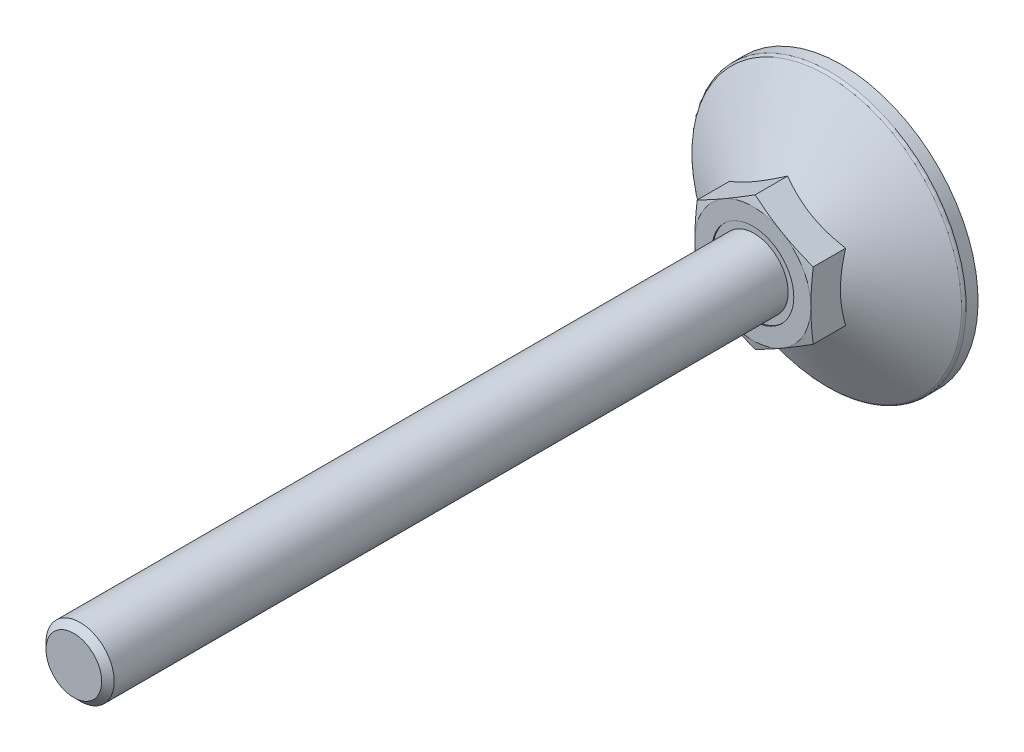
ISO-10303-21;
HEADER;
FILE_DESCRIPTION(('STEP AP214'),'2;1');
FILE_NAME('part.step','',(''),(''),'','','');
FILE_SCHEMA(('AUTOMOTIVE_DESIGN { 1 0 10303 214 1 1 1 1 }'));
ENDSEC;
DATA;
#1=APPLICATION_CONTEXT('core data for automotive mechanical design processes');
#2=APPLICATION_PROTOCOL_DEFINITION('international standard','automotive_design',2000,#1);
#3=PRODUCT_CONTEXT('',#1,'mechanical');
#4=PRODUCT('Part','Part','',(#3));
#5=PRODUCT_RELATED_PRODUCT_CATEGORY('part','',(#4));
#6=PRODUCT_DEFINITION_FORMATION('','',#4);
#7=PRODUCT_DEFINITION_CONTEXT('part definition',#1,'design');
#8=PRODUCT_DEFINITION('design','',#6,#7);
#9=PRODUCT_DEFINITION_SHAPE('','',#8);
#10=(LENGTH_UNIT() NAMED_UNIT(*) SI_UNIT(.MILLI.,.METRE.));
#11=(NAMED_UNIT(*) PLANE_ANGLE_UNIT() SI_UNIT($,.RADIAN.));
#12=(NAMED_UNIT(*) SI_UNIT($,.STERADIAN.) SOLID_ANGLE_UNIT());
#13=UNCERTAINTY_MEASURE_WITH_UNIT(LENGTH_MEASURE(1.E-05),#10,'distance_accuracy_value','');
#14=(GEOMETRIC_REPRESENTATION_CONTEXT(3) GLOBAL_UNCERTAINTY_ASSIGNED_CONTEXT((#13)) GLOBAL_UNIT_ASSIGNED_CONTEXT((#10,
#11,#12)) REPRESENTATION_CONTEXT('',''));
#15=CARTESIAN_POINT('',(0.,0.,0.));
#16=DIRECTION('',(0.,0.,1.));
#17=DIRECTION('',(1.,0.,0.));
#18=AXIS2_PLACEMENT_3D('',#15,#16,#17);
#19=CARTESIAN_POINT('',(0.,9.8149545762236,27.));
#20=DIRECTION('',(0.5,-0.86602540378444,0.));
#21=DIRECTION('',(0.86602540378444,0.5,0.));
#22=AXIS2_PLACEMENT_3D('',#19,#20,#21);
#23=PLANE('',#22);
#24=CARTESIAN_POINT('',(0.000200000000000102,9.81507004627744,12.6476280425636));
#25=CARTESIAN_POINT('',(-0.352800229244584,9.61126526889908,12.7022599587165));
#26=CARTESIAN_POINT('',(-0.706440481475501,9.40709097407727,12.7518566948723));
#27=CARTESIAN_POINT('',(-1.41496987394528,8.99802133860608,12.8389934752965));
#28=CARTESIAN_POINT('',(-1.76985946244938,8.79312573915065,12.8765286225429));
#29=CARTESIAN_POINT('',(-2.47873586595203,8.38385575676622,12.9373509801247));
#30=CARTESIAN_POINT('',(-2.83271788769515,8.17948414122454,12.9607107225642));
#31=CARTESIAN_POINT('',(-3.5411333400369,7.77048028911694,12.9920337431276));
#32=CARTESIAN_POINT('',(-3.89556667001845,7.56584811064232,13.));
#33=CARTESIAN_POINT('',(-4.60443332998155,7.15658375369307,13.));
#34=CARTESIAN_POINT('',(-4.9588666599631,6.95195157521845,12.9920337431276));
#35=CARTESIAN_POINT('',(-5.66728211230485,6.54294772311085,12.9607107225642));
#36=CARTESIAN_POINT('',(-6.02126413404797,6.33857610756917,12.9373509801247));
#37=CARTESIAN_POINT('',(-6.73014053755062,5.92930612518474,12.8765286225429));
#38=CARTESIAN_POINT('',(-7.08503012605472,5.7244105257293,12.8389934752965));
#39=CARTESIAN_POINT('',(-7.7935595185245,5.31534089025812,12.7518566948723));
#40=CARTESIAN_POINT('',(-8.14719977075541,5.11116659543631,12.7022599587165));
#41=CARTESIAN_POINT('',(-8.5002,4.90736181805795,12.6476280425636));
#42=B_SPLINE_CURVE_WITH_KNOTS('',3,(#24,#25,#26,#27,#28,#29,#30,#31,#32,#33,#34,#35,#36,#37,#38,
#39,#40,#41),.UNSPECIFIED.,.F.,.F.,(4,2,2,2,2,2,2,2,4),(0.,1.23382789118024,2.46815608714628,
3.69611406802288,4.92383440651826,6.15155474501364,7.37951272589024,8.61384092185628,
9.84766881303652),.UNSPECIFIED.);
#43=CARTESIAN_POINT('',(0.,9.8149545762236,12.6476589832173));
#44=VERTEX_POINT('',#43);
#45=CARTESIAN_POINT('',(-4.25,7.36121593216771,13.));
#46=VERTEX_POINT('',#45);
#47=EDGE_CURVE('E269',#44,#46,#42,.T.);
#48=ORIENTED_EDGE('',*,*,#47,.F.);
#49=DIRECTION('',(0.,0.,-1.));
#50=VECTOR('',#49,1.);
#51=CARTESIAN_POINT('',(0.,9.8149545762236,27.));
#52=LINE('',#51,#50);
#53=CARTESIAN_POINT('',(0.,9.8149545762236,7.90533871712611));
#54=VERTEX_POINT('',#53);
#55=EDGE_CURVE('E43',#44,#54,#52,.T.);
#56=ORIENTED_EDGE('',*,*,#55,.T.);
#57=CARTESIAN_POINT('',(-8.5002,4.90736181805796,7.90527204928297));
#58=CARTESIAN_POINT('',(-8.31336077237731,5.0152334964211,7.96754195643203));
#59=CARTESIAN_POINT('',(-8.1258249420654,5.12350735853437,8.02698579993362));
#60=CARTESIAN_POINT('',(-7.74923024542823,5.34093440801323,8.13944298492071));
#61=CARTESIAN_POINT('',(-7.56017075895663,5.45008795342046,8.19245355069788));
#62=CARTESIAN_POINT('',(-6.98996524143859,5.77929626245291,8.34079470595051));
#63=CARTESIAN_POINT('',(-6.60656835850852,6.00065055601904,8.42516916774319));
#64=CARTESIAN_POINT('',(-6.03282233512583,6.33190297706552,8.52410807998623));
#65=CARTESIAN_POINT('',(-5.8441872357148,6.44081150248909,8.55229289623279));
#66=CARTESIAN_POINT('',(-5.46606397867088,6.65912106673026,8.59955401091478));
#67=CARTESIAN_POINT('',(-5.27657589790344,6.76852206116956,8.61863111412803));
#68=CARTESIAN_POINT('',(-4.89727347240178,6.98751241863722,8.64719332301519));
#69=CARTESIAN_POINT('',(-4.70745974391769,7.0971014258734,8.65668931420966));
#70=CARTESIAN_POINT('',(-4.3276569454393,7.31638067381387,8.66588571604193));
#71=CARTESIAN_POINT('',(-4.13766788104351,7.42607091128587,8.66558642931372));
#72=CARTESIAN_POINT('',(-3.78247698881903,7.63114046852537,8.65587362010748));
#73=CARTESIAN_POINT('',(-3.61725009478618,7.7265342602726,8.64764492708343));
#74=CARTESIAN_POINT('',(-3.28718328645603,7.91709842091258,8.62393885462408));
#75=CARTESIAN_POINT('',(-3.12234339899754,8.01226877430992,8.60846098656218));
#76=CARTESIAN_POINT('',(-2.62846189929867,8.29741139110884,8.55151947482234));
#77=CARTESIAN_POINT('',(-2.30029449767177,8.48687892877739,8.49955503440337));
#78=CARTESIAN_POINT('',(-1.64047857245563,8.86782383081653,8.36964315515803));
#79=CARTESIAN_POINT('',(-1.30891425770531,9.0592525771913,8.29114502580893));
#80=CARTESIAN_POINT('',(-0.650730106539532,9.43925537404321,8.11298675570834));
#81=CARTESIAN_POINT('',(-0.324101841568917,9.62783429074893,8.01336845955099));
#82=CARTESIAN_POINT('',(0.000199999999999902,9.81507004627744,7.90527204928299));
#83=B_SPLINE_CURVE_WITH_KNOTS('',3,(#57,#58,#59,#60,#61,#62,#63,#64,#65,#66,#67,#68,#69,#70,#71,
#72,#73,#74,#75,#76,#77,#78,#79,#80,#81,#82),.UNSPECIFIED.,.F.,.F.,(4,2,2,2,2,2,2,2,2,2,2,2,4),
(0.,0.673596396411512,1.34748239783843,2.69805431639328,3.35679995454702,4.01548737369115,
4.67342558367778,5.33134346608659,5.90409556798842,6.47688628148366,7.62328361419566,
8.79510569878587,9.96462743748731),.UNSPECIFIED.);
#84=CARTESIAN_POINT('',(-8.5,4.9074772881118,7.90533871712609));
#85=VERTEX_POINT('',#84);
#86=EDGE_CURVE('E237',#85,#54,#83,.T.);
#87=ORIENTED_EDGE('',*,*,#86,.F.);
#88=DIRECTION('',(0.,0.,-1.));
#89=VECTOR('',#88,1.);
#90=CARTESIAN_POINT('',(-8.5,4.9074772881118,27.));
#91=LINE('',#90,#89);
#92=CARTESIAN_POINT('',(-8.5,4.9074772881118,12.6476589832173));
#93=VERTEX_POINT('',#92);
#94=EDGE_CURVE('E282',#93,#85,#91,.T.);
#95=ORIENTED_EDGE('',*,*,#94,.F.);
#96=EDGE_CURVE('E169',#46,#93,#42,.T.);
#97=ORIENTED_EDGE('',*,*,#96,.F.);
#98=EDGE_LOOP('',(#48,#56,#87,#95,#97));
#99=FACE_BOUND('',#98,.T.);
#100=ADVANCED_FACE('F14',(#99),#23,.F.);
#101=CARTESIAN_POINT('',(8.5,4.9074772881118,27.));
#102=DIRECTION('',(-0.5,-0.86602540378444,0.));
#103=DIRECTION('',(0.86602540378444,-0.5,0.));
#104=AXIS2_PLACEMENT_3D('',#101,#102,#103);
#105=PLANE('',#104);
#106=CARTESIAN_POINT('',(8.5002,4.90736181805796,12.6476280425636));
#107=CARTESIAN_POINT('',(8.14719977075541,5.11116659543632,12.7022599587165));
#108=CARTESIAN_POINT('',(7.7935595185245,5.31534089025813,12.7518566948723));
#109=CARTESIAN_POINT('',(7.08503012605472,5.72441052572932,12.8389934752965));
#110=CARTESIAN_POINT('',(6.73014053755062,5.92930612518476,12.8765286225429));
#111=CARTESIAN_POINT('',(6.02126413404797,6.33857610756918,12.9373509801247));
#112=CARTESIAN_POINT('',(5.66728211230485,6.54294772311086,12.9607107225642));
#113=CARTESIAN_POINT('',(4.9588666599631,6.95195157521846,12.9920337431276));
#114=CARTESIAN_POINT('',(4.60443332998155,7.15658375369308,13.));
#115=CARTESIAN_POINT('',(3.89556667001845,7.56584811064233,13.));
#116=CARTESIAN_POINT('',(3.5411333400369,7.77048028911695,12.9920337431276));
#117=CARTESIAN_POINT('',(2.83271788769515,8.17948414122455,12.9607107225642));
#118=CARTESIAN_POINT('',(2.47873586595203,8.38385575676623,12.9373509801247));
#119=CARTESIAN_POINT('',(1.76985946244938,8.79312573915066,12.8765286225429));
#120=CARTESIAN_POINT('',(1.41496987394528,8.9980213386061,12.8389934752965));
#121=CARTESIAN_POINT('',(0.706440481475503,9.40709097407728,12.7518566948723));
#122=CARTESIAN_POINT('',(0.352800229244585,9.61126526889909,12.7022599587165));
#123=CARTESIAN_POINT('',(-0.000200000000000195,9.81507004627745,12.6476280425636));
#124=B_SPLINE_CURVE_WITH_KNOTS('',3,(#106,#107,#108,#109,#110,#111,#112,#113,#114,#115,#116,
#117,#118,#119,#120,#121,#122,#123),.UNSPECIFIED.,.F.,.F.,(4,2,2,2,2,2,2,2,4),(0.,
1.23382789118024,2.46815608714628,3.69611406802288,4.92383440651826,6.15155474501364,
7.37951272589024,8.61384092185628,9.84766881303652),.UNSPECIFIED.);
#125=CARTESIAN_POINT('',(8.5,4.9074772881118,12.6476589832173));
#126=VERTEX_POINT('',#125);
#127=CARTESIAN_POINT('',(4.25,7.36121593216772,13.));
#128=VERTEX_POINT('',#127);
#129=EDGE_CURVE('E121',#126,#128,#124,.T.);
#130=ORIENTED_EDGE('',*,*,#129,.F.);
#131=DIRECTION('',(0.,0.,-1.));
#132=VECTOR('',#131,1.);
#133=CARTESIAN_POINT('',(8.5,4.9074772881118,27.));
#134=LINE('',#133,#132);
#135=CARTESIAN_POINT('',(8.5,4.9074772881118,7.90533871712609));
#136=VERTEX_POINT('',#135);
#137=EDGE_CURVE('E128',#126,#136,#134,.T.);
#138=ORIENTED_EDGE('',*,*,#137,.T.);
#139=CARTESIAN_POINT('',(-0.0002,9.81507004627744,7.90527204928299));
#140=CARTESIAN_POINT('',(0.186639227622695,9.7071983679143,7.96754195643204));
#141=CARTESIAN_POINT('',(0.374175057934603,9.59892450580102,8.02698579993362));
#142=CARTESIAN_POINT('',(0.750769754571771,9.38149745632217,8.13944298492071));
#143=CARTESIAN_POINT('',(0.939829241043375,9.27234391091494,8.19245355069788));
#144=CARTESIAN_POINT('',(1.51003475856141,8.94313560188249,8.34079470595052));
#145=CARTESIAN_POINT('',(1.89343164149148,8.72178130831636,8.42516916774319));
#146=CARTESIAN_POINT('',(2.46717766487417,8.39052888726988,8.52410807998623));
#147=CARTESIAN_POINT('',(2.6558127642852,8.28162036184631,8.55229289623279));
#148=CARTESIAN_POINT('',(3.03393602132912,8.06331079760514,8.59955401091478));
#149=CARTESIAN_POINT('',(3.22342410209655,7.95390980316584,8.61863111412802));
#150=CARTESIAN_POINT('',(3.60272652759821,7.73491944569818,8.64719332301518));
#151=CARTESIAN_POINT('',(3.79254025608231,7.62533043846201,8.65668931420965));
#152=CARTESIAN_POINT('',(4.1723430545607,7.40605119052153,8.66588571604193));
#153=CARTESIAN_POINT('',(4.36233211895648,7.29636095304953,8.66558642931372));
#154=CARTESIAN_POINT('',(4.71752301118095,7.09129139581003,8.65587362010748));
#155=CARTESIAN_POINT('',(4.88274990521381,6.9958976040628,8.64764492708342));
#156=CARTESIAN_POINT('',(5.21281671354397,6.80533344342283,8.62393885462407));
#157=CARTESIAN_POINT('',(5.37765660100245,6.71016309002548,8.60846098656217));
#158=CARTESIAN_POINT('',(5.87153810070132,6.42502047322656,8.55151947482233));
#159=CARTESIAN_POINT('',(6.19970550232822,6.23555293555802,8.49955503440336));
#160=CARTESIAN_POINT('',(6.85952142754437,5.85460803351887,8.36964315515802));
#161=CARTESIAN_POINT('',(7.19108574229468,5.6631792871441,8.29114502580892));
#162=CARTESIAN_POINT('',(7.84926989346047,5.28317649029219,8.11298675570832));
#163=CARTESIAN_POINT('',(8.17589815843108,5.09459757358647,8.01336845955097));
#164=CARTESIAN_POINT('',(8.5002,4.90736181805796,7.90527204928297));
#165=B_SPLINE_CURVE_WITH_KNOTS('',3,(#139,#140,#141,#142,#143,#144,#145,#146,#147,#148,#149,
#150,#151,#152,#153,#154,#155,#156,#157,#158,#159,#160,#161,#162,#163,#164),.UNSPECIFIED.,.F.,
.F.,(4,2,2,2,2,2,2,2,2,2,2,2,4),(0.,0.673596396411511,1.34748239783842,2.69805431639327,
3.35679995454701,4.01548737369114,4.67342558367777,5.33134346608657,5.90409556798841,
6.47688628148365,7.62328361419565,8.79510569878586,9.96462743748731),.UNSPECIFIED.);
#166=EDGE_CURVE('E231',#54,#136,#165,.T.);
#167=ORIENTED_EDGE('',*,*,#166,.F.);
#168=ORIENTED_EDGE('',*,*,#55,.F.);
#169=EDGE_CURVE('E138',#128,#44,#124,.T.);
#170=ORIENTED_EDGE('',*,*,#169,.F.);
#171=EDGE_LOOP('',(#130,#138,#167,#168,#170));
#172=FACE_BOUND('',#171,.T.);
#173=ADVANCED_FACE('F243',(#172),#105,.F.);
#174=CARTESIAN_POINT('',(8.5,-4.9074772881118,27.));
#175=DIRECTION('',(-1.,0.,0.));
#176=DIRECTION('',(0.,-1.,0.));
#177=AXIS2_PLACEMENT_3D('',#174,#175,#176);
#178=PLANE('',#177);
#179=CARTESIAN_POINT('',(8.5,-12.9938664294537,11.1170965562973));
#180=CARTESIAN_POINT('',(8.5,-12.6081115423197,11.2035725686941));
#181=CARTESIAN_POINT('',(8.5,-12.2221157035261,11.2889929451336));
#182=CARTESIAN_POINT('',(8.5,-11.4495237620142,11.4571526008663));
#183=CARTESIAN_POINT('',(8.5,-11.0629276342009,11.5398917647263));
#184=CARTESIAN_POINT('',(8.5,-10.2886720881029,11.7021908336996));
#185=CARTESIAN_POINT('',(8.5,-9.9010120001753,11.7817475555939));
#186=CARTESIAN_POINT('',(8.5,-9.12488580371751,11.9368248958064));
#187=CARTESIAN_POINT('',(8.5,-8.73641970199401,12.0123455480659));
#188=CARTESIAN_POINT('',(8.5,-7.96163672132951,12.1578078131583));
#189=CARTESIAN_POINT('',(8.5,-7.57532731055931,12.2277890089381));
#190=CARTESIAN_POINT('',(8.5,-6.80165540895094,12.3616546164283));
#191=CARTESIAN_POINT('',(8.5,-6.41429294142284,12.4255391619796));
#192=CARTESIAN_POINT('',(8.5,-5.63843832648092,12.5457755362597));
#193=CARTESIAN_POINT('',(8.5,-5.24994632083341,12.6021282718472));
#194=CARTESIAN_POINT('',(8.5,-4.47172566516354,12.7056425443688));
#195=CARTESIAN_POINT('',(8.5,-4.08199701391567,12.7528040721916));
#196=CARTESIAN_POINT('',(8.5,-3.29690132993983,12.8366030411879));
#197=CARTESIAN_POINT('',(8.5,-2.90152064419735,12.8731144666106));
#198=CARTESIAN_POINT('',(8.5,-2.109762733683,12.9330960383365));
#199=CARTESIAN_POINT('',(8.5,-1.71338553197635,12.9565664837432));
#200=CARTESIAN_POINT('',(8.5,-0.920209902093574,12.9890973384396));
#201=CARTESIAN_POINT('',(8.5,-0.523411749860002,12.9981643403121));
#202=CARTESIAN_POINT('',(8.5,0.270245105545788,13.0013305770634));
#203=CARTESIAN_POINT('',(8.5,0.667103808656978,12.9954298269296));
#204=CARTESIAN_POINT('',(8.5,1.46176859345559,12.9689923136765));
#205=CARTESIAN_POINT('',(8.5,1.859572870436,12.9484023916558));
#206=CARTESIAN_POINT('',(8.5,2.6542474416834,12.8937629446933));
#207=CARTESIAN_POINT('',(8.5,3.0511177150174,12.8597131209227));
#208=CARTESIAN_POINT('',(8.5,3.84392064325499,12.7798767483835));
#209=CARTESIAN_POINT('',(8.5,4.23985251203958,12.7340825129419));
#210=CARTESIAN_POINT('',(8.5,5.0304415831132,12.6326664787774));
#211=CARTESIAN_POINT('',(8.5,5.4250987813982,12.5770446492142));
#212=CARTESIAN_POINT('',(8.5,6.18787774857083,12.4615858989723));
#213=CARTESIAN_POINT('',(8.5,6.556075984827,12.4022490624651));
#214=CARTESIAN_POINT('',(8.5,7.29149946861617,12.2777973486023));
#215=CARTESIAN_POINT('',(8.5,7.65872468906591,12.2126823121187));
#216=CARTESIAN_POINT('',(8.5,8.39233685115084,12.0777320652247));
#217=CARTESIAN_POINT('',(8.5,8.7587237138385,12.0078964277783));
#218=CARTESIAN_POINT('',(8.5,9.49074472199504,11.8643748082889));
#219=CARTESIAN_POINT('',(8.5,9.85637885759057,11.7906887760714));
#220=CARTESIAN_POINT('',(8.5,10.5870796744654,11.640147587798));
#221=CARTESIAN_POINT('',(8.5,10.9521462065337,11.5632917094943));
#222=CARTESIAN_POINT('',(8.5,11.6817229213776,11.4069794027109));
#223=CARTESIAN_POINT('',(8.5,12.0462331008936,11.3275229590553));
#224=CARTESIAN_POINT('',(8.5,13.139004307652,11.0859560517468));
#225=CARTESIAN_POINT('',(8.5,13.8665558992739,10.9206375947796));
#226=CARTESIAN_POINT('',(8.5,15.3131197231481,10.5856936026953));
#227=CARTESIAN_POINT('',(8.5,16.0321455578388,10.4161264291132));
#228=CARTESIAN_POINT('',(8.5,17.469195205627,10.0727473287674));
#229=CARTESIAN_POINT('',(8.5,18.1872190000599,9.89893532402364));
#230=CARTESIAN_POINT('',(8.5,19.6216081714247,9.54839824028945));
#231=CARTESIAN_POINT('',(8.5,20.3379745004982,9.37167704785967));
#232=CARTESIAN_POINT('',(8.5,21.7700838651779,9.01582597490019));
#233=CARTESIAN_POINT('',(8.5,22.4858269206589,8.83669617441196));
#234=CARTESIAN_POINT('',(8.5,23.201352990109,8.65671340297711));
#235=B_SPLINE_CURVE_WITH_KNOTS('',3,(#179,#180,#181,#182,#183,#184,#185,#186,#187,#188,#189,
#190,#191,#192,#193,#194,#195,#196,#197,#198,#199,#200,#201,#202,#203,#204,#205,#206,#207,#208,
#209,#210,#211,#212,#213,#214,#215,#216,#217,#218,#219,#220,#221,#222,#223,#224,#225,#226,#227,
#228,#229,#230,#231,#232,#233,#234),.UNSPECIFIED.,.F.,.F.,(4,2,2,2,2,2,2,2,2,2,2,2,2,2,2,2,2,2,
2,2,2,2,2,2,2,2,2,4),(0.,1.18599149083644,2.3720339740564,3.55923454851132,4.74642513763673,
5.92417683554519,7.10190267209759,8.27948657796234,9.45707165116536,10.6480722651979,
11.8390455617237,13.0294735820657,14.2199004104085,15.4146572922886,16.6094407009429,
17.8050080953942,19.0005792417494,20.1193713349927,21.238194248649,22.3571185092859,
23.4760573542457,24.5952525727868,25.714454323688,27.9527049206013,30.1689391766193,
32.3852141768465,34.5987362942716,36.8121850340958),.UNSPECIFIED.);
#236=CARTESIAN_POINT('',(8.5,-4.90747728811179,12.6476589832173));
#237=VERTEX_POINT('',#236);
#238=CARTESIAN_POINT('',(8.5,0.,13.));
#239=VERTEX_POINT('',#238);
#240=EDGE_CURVE('E95',#237,#239,#235,.T.);
#241=ORIENTED_EDGE('',*,*,#240,.F.);
#242=DIRECTION('',(0.,0.,-1.));
#243=VECTOR('',#242,1.);
#244=CARTESIAN_POINT('',(8.5,-4.9074772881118,27.));
#245=LINE('',#244,#243);
#246=CARTESIAN_POINT('',(8.5,-4.9074772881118,7.90533871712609));
#247=VERTEX_POINT('',#246);
#248=EDGE_CURVE('E275',#237,#247,#245,.T.);
#249=ORIENTED_EDGE('',*,*,#248,.T.);
#250=CARTESIAN_POINT('',(8.5,12.7492767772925,4.72527230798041));
#251=CARTESIAN_POINT('',(8.5,12.3811478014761,4.90206026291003));
#252=CARTESIAN_POINT('',(8.5,12.0121249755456,5.07702151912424));
#253=CARTESIAN_POINT('',(8.5,11.2718137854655,5.42225230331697));
#254=CARTESIAN_POINT('',(8.5,10.9005250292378,5.59252098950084));
#255=CARTESIAN_POINT('',(8.5,10.1530767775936,5.92827896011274));
#256=CARTESIAN_POINT('',(8.5,9.77690140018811,6.09373302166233));
#257=CARTESIAN_POINT('',(8.5,9.02139912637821,6.41725455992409));
#258=CARTESIAN_POINT('',(8.5,8.64207239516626,6.57532242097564));
#259=CARTESIAN_POINT('',(8.5,7.86979942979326,6.88607334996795));
#260=CARTESIAN_POINT('',(8.5,7.47675434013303,7.03851219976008));
#261=CARTESIAN_POINT('',(8.5,6.68591204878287,7.33076935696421));
#262=CARTESIAN_POINT('',(8.5,6.28811429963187,7.47058619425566));
#263=CARTESIAN_POINT('',(8.5,5.48802263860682,7.733611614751));
#264=CARTESIAN_POINT('',(8.5,5.08574124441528,7.85685783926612));
#265=CARTESIAN_POINT('',(8.5,4.27544970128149,8.08251258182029));
#266=CARTESIAN_POINT('',(8.5,3.86744153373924,8.18492812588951));
#267=CARTESIAN_POINT('',(8.5,3.04728386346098,8.36327495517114));
#268=CARTESIAN_POINT('',(8.5,2.6351585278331,8.43931422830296));
#269=CARTESIAN_POINT('',(8.5,2.01359122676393,8.53003978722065));
#270=CARTESIAN_POINT('',(8.5,1.80582110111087,8.55639399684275));
#271=CARTESIAN_POINT('',(8.5,1.38940213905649,8.60080126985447));
#272=CARTESIAN_POINT('',(8.5,1.18075338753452,8.61885511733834));
#273=CARTESIAN_POINT('',(8.5,0.765376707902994,8.64609671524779));
#274=CARTESIAN_POINT('',(8.5,0.558655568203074,8.65538769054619));
#275=CARTESIAN_POINT('',(8.5,0.1450067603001,8.66526416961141));
#276=CARTESIAN_POINT('',(8.5,-0.0619209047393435,8.6658498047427));
#277=CARTESIAN_POINT('',(8.5,-0.475626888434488,8.65830085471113));
#278=CARTESIAN_POINT('',(8.5,-0.682405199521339,8.65016585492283));
#279=CARTESIAN_POINT('',(8.5,-1.09545270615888,8.625363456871));
#280=CARTESIAN_POINT('',(8.5,-1.30172187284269,8.60869558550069));
#281=CARTESIAN_POINT('',(8.5,-1.81090940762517,8.55735076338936));
#282=CARTESIAN_POINT('',(8.5,-2.11335210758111,8.51788364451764));
#283=CARTESIAN_POINT('',(8.5,-2.71570235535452,8.4228634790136));
#284=CARTESIAN_POINT('',(8.5,-3.01560949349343,8.36730788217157));
#285=CARTESIAN_POINT('',(8.5,-3.61268959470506,8.2420877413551));
#286=CARTESIAN_POINT('',(8.5,-3.90986014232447,8.17241178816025));
#287=CARTESIAN_POINT('',(8.5,-4.50108875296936,8.02104250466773));
#288=CARTESIAN_POINT('',(8.5,-4.79514688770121,7.93934945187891));
#289=CARTESIAN_POINT('',(8.5,-5.3871494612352,7.7638116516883));
#290=CARTESIAN_POINT('',(8.5,-5.68502188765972,7.6697256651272));
#291=CARTESIAN_POINT('',(8.5,-6.27782977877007,7.4727599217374));
#292=CARTESIAN_POINT('',(8.5,-6.57276522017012,7.36988009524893));
#293=CARTESIAN_POINT('',(8.5,-7.15987047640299,7.15687683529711));
#294=CARTESIAN_POINT('',(8.5,-7.45204129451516,7.04675615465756));
#295=CARTESIAN_POINT('',(8.5,-8.03401937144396,6.82048197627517));
#296=CARTESIAN_POINT('',(8.5,-8.32382669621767,6.70432864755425));
#297=CARTESIAN_POINT('',(8.5,-8.8985343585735,6.468166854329));
#298=CARTESIAN_POINT('',(8.5,-9.18345493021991,6.34820749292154));
#299=CARTESIAN_POINT('',(8.5,-9.75152375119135,6.10415692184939));
#300=CARTESIAN_POINT('',(8.5,-10.034671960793,5.98006561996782));
#301=CARTESIAN_POINT('',(8.5,-10.8818575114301,5.60257794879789));
#302=CARTESIAN_POINT('',(8.5,-11.4435817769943,5.34399030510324));
#303=CARTESIAN_POINT('',(8.5,-12.5625477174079,4.81675169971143));
#304=CARTESIAN_POINT('',(8.5,-13.1197873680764,4.54809647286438));
#305=CARTESIAN_POINT('',(8.5,-14.2306052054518,4.00340707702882));
#306=CARTESIAN_POINT('',(8.5,-14.7841835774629,3.72737328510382));
#307=CARTESIAN_POINT('',(8.5,-15.8894273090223,3.16924748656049));
#308=CARTESIAN_POINT('',(8.5,-16.4410879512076,2.88714616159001));
#309=CARTESIAN_POINT('',(8.5,-17.5421722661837,2.31860293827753));
#310=CARTESIAN_POINT('',(8.5,-18.0915959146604,2.03216099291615));
#311=CARTESIAN_POINT('',(8.5,-19.1885131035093,1.45593769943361));
#312=CARTESIAN_POINT('',(8.5,-19.7360070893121,1.1661571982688));
#313=CARTESIAN_POINT('',(8.5,-20.8295421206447,0.583866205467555));
#314=CARTESIAN_POINT('',(8.5,-21.3755831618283,0.291355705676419));
#315=CARTESIAN_POINT('',(8.5,-22.8810608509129,-0.519031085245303));
#316=CARTESIAN_POINT('',(8.5,-23.8392547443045,-1.03921546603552));
#317=CARTESIAN_POINT('',(8.5,-25.7530641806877,-2.08445783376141));
#318=CARTESIAN_POINT('',(8.5,-26.708679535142,-2.60951616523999));
#319=CARTESIAN_POINT('',(8.5,-28.6148788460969,-3.66152013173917));
#320=CARTESIAN_POINT('',(8.5,-29.565469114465,-4.18845433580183));
#321=CARTESIAN_POINT('',(8.5,-30.9901906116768,-4.98085413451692));
#322=CARTESIAN_POINT('',(8.5,-31.4648842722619,-5.24530955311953));
#323=CARTESIAN_POINT('',(8.5,-32.4139385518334,-5.77481644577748));
#324=CARTESIAN_POINT('',(8.5,-32.8882991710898,-6.03986791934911));
#325=CARTESIAN_POINT('',(8.5,-33.3625145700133,-6.30517901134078));
#326=B_SPLINE_CURVE_WITH_KNOTS('',3,(#250,#251,#252,#253,#254,#255,#256,#257,#258,#259,#260,
#261,#262,#263,#264,#265,#266,#267,#268,#269,#270,#271,#272,#273,#274,#275,#276,#277,#278,#279,
#280,#281,#282,#283,#284,#285,#286,#287,#288,#289,#290,#291,#292,#293,#294,#295,#296,#297,#298,
#299,#300,#301,#302,#303,#304,#305,#306,#307,#308,#309,#310,#311,#312,#313,#314,#315,#316,#317,
#318,#319,#320,#321,#322,#323,#324,#325),.UNSPECIFIED.,.F.,.F.,(4,2,2,2,2,2,2,2,2,2,2,2,2,2,2,2,
2,2,2,2,2,2,2,2,2,2,2,2,2,2,2,2,2,2,2,2,2,4),(0.,1.22515253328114,2.45052343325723,
3.6833213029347,4.91605495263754,6.18059988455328,7.44529191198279,8.70706073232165,
9.96840325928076,11.2245189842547,11.852683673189,12.4807890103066,13.1013994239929,
13.7220004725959,14.3426310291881,14.9632960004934,15.8778021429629,16.7924533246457,
17.7078465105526,18.6232185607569,19.5601888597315,20.4971665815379,21.433790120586,
22.3703874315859,23.297780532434,24.225194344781,26.0801973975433,27.9359954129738,
29.7916987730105,31.6504906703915,33.5093027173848,35.3676531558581,37.2260091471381,
40.4968499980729,43.7679238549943,47.0285209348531,48.6586852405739,50.2888482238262),.UNSPECIFIED.);
#327=EDGE_CURVE('E197',#136,#247,#326,.T.);
#328=ORIENTED_EDGE('',*,*,#327,.F.);
#329=ORIENTED_EDGE('',*,*,#137,.F.);
#330=EDGE_CURVE('E106',#239,#126,#235,.T.);
#331=ORIENTED_EDGE('',*,*,#330,.F.);
#332=EDGE_LOOP('',(#241,#249,#328,#329,#331));
#333=FACE_BOUND('',#332,.T.);
#334=ADVANCED_FACE('F126',(#333),#178,.F.);
#335=CARTESIAN_POINT('',(0.,-9.8149545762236,27.));
#336=DIRECTION('',(-0.5,0.86602540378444,0.));
#337=DIRECTION('',(-0.86602540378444,-0.5,0.));
#338=AXIS2_PLACEMENT_3D('',#335,#336,#337);
#339=PLANE('',#338);
#340=CARTESIAN_POINT('',(-0.000200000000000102,-9.81507004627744,12.6476280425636));
#341=CARTESIAN_POINT('',(0.352800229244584,-9.61126526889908,12.7022599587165));
#342=CARTESIAN_POINT('',(0.706440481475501,-9.40709097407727,12.7518566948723));
#343=CARTESIAN_POINT('',(1.41496987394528,-8.99802133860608,12.8389934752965));
#344=CARTESIAN_POINT('',(1.76985946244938,-8.79312573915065,12.8765286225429));
#345=CARTESIAN_POINT('',(2.47873586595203,-8.38385575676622,12.9373509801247));
#346=CARTESIAN_POINT('',(2.83271788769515,-8.17948414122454,12.9607107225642));
#347=CARTESIAN_POINT('',(3.5411333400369,-7.77048028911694,12.9920337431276));
#348=CARTESIAN_POINT('',(3.89556667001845,-7.56584811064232,13.));
#349=CARTESIAN_POINT('',(4.60443332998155,-7.15658375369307,13.));
#350=CARTESIAN_POINT('',(4.9588666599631,-6.95195157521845,12.9920337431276));
#351=CARTESIAN_POINT('',(5.66728211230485,-6.54294772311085,12.9607107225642));
#352=CARTESIAN_POINT('',(6.02126413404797,-6.33857610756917,12.9373509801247));
#353=CARTESIAN_POINT('',(6.73014053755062,-5.92930612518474,12.8765286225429));
#354=CARTESIAN_POINT('',(7.08503012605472,-5.7244105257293,12.8389934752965));
#355=CARTESIAN_POINT('',(7.7935595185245,-5.31534089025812,12.7518566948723));
#356=CARTESIAN_POINT('',(8.14719977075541,-5.11116659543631,12.7022599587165));
#357=CARTESIAN_POINT('',(8.5002,-4.90736181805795,12.6476280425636));
#358=B_SPLINE_CURVE_WITH_KNOTS('',3,(#340,#341,#342,#343,#344,#345,#346,#347,#348,#349,#350,
#351,#352,#353,#354,#355,#356,#357),.UNSPECIFIED.,.F.,.F.,(4,2,2,2,2,2,2,2,4),(0.,
1.23382789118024,2.46815608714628,3.69611406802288,4.92383440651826,6.15155474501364,
7.37951272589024,8.61384092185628,9.84766881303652),.UNSPECIFIED.);
#359=CARTESIAN_POINT('',(0.,-9.81495457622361,12.6476589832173));
#360=VERTEX_POINT('',#359);
#361=CARTESIAN_POINT('',(4.25,-7.36121593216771,13.));
#362=VERTEX_POINT('',#361);
#363=EDGE_CURVE('E130',#360,#362,#358,.T.);
#364=ORIENTED_EDGE('',*,*,#363,.F.);
#365=DIRECTION('',(0.,0.,-1.));
#366=VECTOR('',#365,1.);
#367=CARTESIAN_POINT('',(0.,-9.8149545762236,27.));
#368=LINE('',#367,#366);
#369=CARTESIAN_POINT('',(0.,-9.8149545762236,7.90533871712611));
#370=VERTEX_POINT('',#369);
#371=EDGE_CURVE('E279',#360,#370,#368,.T.);
#372=ORIENTED_EDGE('',*,*,#371,.T.);
#373=CARTESIAN_POINT('',(8.5002,-4.90736181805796,7.90527204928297));
#374=CARTESIAN_POINT('',(8.31336077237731,-5.0152334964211,7.96754195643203));
#375=CARTESIAN_POINT('',(8.1258249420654,-5.12350735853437,8.02698579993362));
#376=CARTESIAN_POINT('',(7.74923024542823,-5.34093440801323,8.13944298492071));
#377=CARTESIAN_POINT('',(7.56017075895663,-5.45008795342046,8.19245355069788));
#378=CARTESIAN_POINT('',(6.98996524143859,-5.77929626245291,8.34079470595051));
#379=CARTESIAN_POINT('',(6.60656835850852,-6.00065055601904,8.42516916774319));
#380=CARTESIAN_POINT('',(6.03282233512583,-6.33190297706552,8.52410807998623));
#381=CARTESIAN_POINT('',(5.8441872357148,-6.44081150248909,8.55229289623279));
#382=CARTESIAN_POINT('',(5.46606397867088,-6.65912106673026,8.59955401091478));
#383=CARTESIAN_POINT('',(5.27657589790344,-6.76852206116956,8.61863111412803));
#384=CARTESIAN_POINT('',(4.89727347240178,-6.98751241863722,8.64719332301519));
#385=CARTESIAN_POINT('',(4.70745974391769,-7.0971014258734,8.65668931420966));
#386=CARTESIAN_POINT('',(4.3276569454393,-7.31638067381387,8.66588571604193));
#387=CARTESIAN_POINT('',(4.13766788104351,-7.42607091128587,8.66558642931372));
#388=CARTESIAN_POINT('',(3.78247698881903,-7.63114046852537,8.65587362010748));
#389=CARTESIAN_POINT('',(3.61725009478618,-7.7265342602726,8.64764492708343));
#390=CARTESIAN_POINT('',(3.28718328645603,-7.91709842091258,8.62393885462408));
#391=CARTESIAN_POINT('',(3.12234339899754,-8.01226877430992,8.60846098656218));
#392=CARTESIAN_POINT('',(2.62846189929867,-8.29741139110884,8.55151947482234));
#393=CARTESIAN_POINT('',(2.30029449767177,-8.48687892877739,8.49955503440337));
#394=CARTESIAN_POINT('',(1.64047857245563,-8.86782383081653,8.36964315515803));
#395=CARTESIAN_POINT('',(1.30891425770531,-9.0592525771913,8.29114502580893));
#396=CARTESIAN_POINT('',(0.650730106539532,-9.43925537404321,8.11298675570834));
#397=CARTESIAN_POINT('',(0.324101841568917,-9.62783429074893,8.01336845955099));
#398=CARTESIAN_POINT('',(-0.000199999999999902,-9.81507004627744,7.90527204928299));
#399=B_SPLINE_CURVE_WITH_KNOTS('',3,(#373,#374,#375,#376,#377,#378,#379,#380,#381,#382,#383,
#384,#385,#386,#387,#388,#389,#390,#391,#392,#393,#394,#395,#396,#397,#398),.UNSPECIFIED.,.F.,
.F.,(4,2,2,2,2,2,2,2,2,2,2,2,4),(0.,0.673596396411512,1.34748239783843,2.69805431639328,
3.35679995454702,4.01548737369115,4.67342558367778,5.33134346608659,5.90409556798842,
6.47688628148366,7.62328361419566,8.79510569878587,9.96462743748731),.UNSPECIFIED.);
#400=EDGE_CURVE('E188',#247,#370,#399,.T.);
#401=ORIENTED_EDGE('',*,*,#400,.F.);
#402=ORIENTED_EDGE('',*,*,#248,.F.);
#403=EDGE_CURVE('E101',#362,#237,#358,.T.);
#404=ORIENTED_EDGE('',*,*,#403,.F.);
#405=EDGE_LOOP('',(#364,#372,#401,#402,#404));
#406=FACE_BOUND('',#405,.T.);
#407=ADVANCED_FACE('F180',(#406),#339,.F.);
#408=CARTESIAN_POINT('',(-8.5,-4.9074772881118,27.));
#409=DIRECTION('',(0.5,0.86602540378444,0.));
#410=DIRECTION('',(-0.86602540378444,0.5,0.));
#411=AXIS2_PLACEMENT_3D('',#408,#409,#410);
#412=PLANE('',#411);
#413=CARTESIAN_POINT('',(-8.5002,-4.90736181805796,12.6476280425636));
#414=CARTESIAN_POINT('',(-8.14719977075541,-5.11116659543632,12.7022599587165));
#415=CARTESIAN_POINT('',(-7.7935595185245,-5.31534089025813,12.7518566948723));
#416=CARTESIAN_POINT('',(-7.08503012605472,-5.72441052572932,12.8389934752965));
#417=CARTESIAN_POINT('',(-6.73014053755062,-5.92930612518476,12.8765286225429));
#418=CARTESIAN_POINT('',(-6.02126413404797,-6.33857610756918,12.9373509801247));
#419=CARTESIAN_POINT('',(-5.66728211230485,-6.54294772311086,12.9607107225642));
#420=CARTESIAN_POINT('',(-4.9588666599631,-6.95195157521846,12.9920337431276));
#421=CARTESIAN_POINT('',(-4.60443332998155,-7.15658375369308,13.));
#422=CARTESIAN_POINT('',(-3.89556667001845,-7.56584811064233,13.));
#423=CARTESIAN_POINT('',(-3.5411333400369,-7.77048028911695,12.9920337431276));
#424=CARTESIAN_POINT('',(-2.83271788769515,-8.17948414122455,12.9607107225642));
#425=CARTESIAN_POINT('',(-2.47873586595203,-8.38385575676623,12.9373509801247));
#426=CARTESIAN_POINT('',(-1.76985946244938,-8.79312573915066,12.8765286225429));
#427=CARTESIAN_POINT('',(-1.41496987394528,-8.9980213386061,12.8389934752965));
#428=CARTESIAN_POINT('',(-0.706440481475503,-9.40709097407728,12.7518566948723));
#429=CARTESIAN_POINT('',(-0.352800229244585,-9.61126526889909,12.7022599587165));
#430=CARTESIAN_POINT('',(0.000200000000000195,-9.81507004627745,12.6476280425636));
#431=B_SPLINE_CURVE_WITH_KNOTS('',3,(#413,#414,#415,#416,#417,#418,#419,#420,#421,#422,#423,
#424,#425,#426,#427,#428,#429,#430),.UNSPECIFIED.,.F.,.F.,(4,2,2,2,2,2,2,2,4),(0.,
1.23382789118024,2.46815608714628,3.69611406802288,4.92383440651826,6.15155474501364,
7.37951272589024,8.61384092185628,9.84766881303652),.UNSPECIFIED.);
#432=CARTESIAN_POINT('',(-8.5,-4.9074772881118,12.6476589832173));
#433=VERTEX_POINT('',#432);
#434=CARTESIAN_POINT('',(-4.25,-7.36121593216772,13.));
#435=VERTEX_POINT('',#434);
#436=EDGE_CURVE('E161',#433,#435,#431,.T.);
#437=ORIENTED_EDGE('',*,*,#436,.F.);
#438=DIRECTION('',(0.,0.,-1.));
#439=VECTOR('',#438,1.);
#440=CARTESIAN_POINT('',(-8.5,-4.9074772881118,27.));
#441=LINE('',#440,#439);
#442=CARTESIAN_POINT('',(-8.5,-4.9074772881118,7.90533871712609));
#443=VERTEX_POINT('',#442);
#444=EDGE_CURVE('E281',#433,#443,#441,.T.);
#445=ORIENTED_EDGE('',*,*,#444,.T.);
#446=CARTESIAN_POINT('',(0.0002,-9.81507004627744,7.90527204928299));
#447=CARTESIAN_POINT('',(-0.186639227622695,-9.7071983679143,7.96754195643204));
#448=CARTESIAN_POINT('',(-0.374175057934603,-9.59892450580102,8.02698579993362));
#449=CARTESIAN_POINT('',(-0.750769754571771,-9.38149745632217,8.13944298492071));
#450=CARTESIAN_POINT('',(-0.939829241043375,-9.27234391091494,8.19245355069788));
#451=CARTESIAN_POINT('',(-1.51003475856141,-8.94313560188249,8.34079470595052));
#452=CARTESIAN_POINT('',(-1.89343164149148,-8.72178130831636,8.42516916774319));
#453=CARTESIAN_POINT('',(-2.46717766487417,-8.39052888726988,8.52410807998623));
#454=CARTESIAN_POINT('',(-2.6558127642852,-8.28162036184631,8.55229289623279));
#455=CARTESIAN_POINT('',(-3.03393602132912,-8.06331079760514,8.59955401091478));
#456=CARTESIAN_POINT('',(-3.22342410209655,-7.95390980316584,8.61863111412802));
#457=CARTESIAN_POINT('',(-3.60272652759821,-7.73491944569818,8.64719332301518));
#458=CARTESIAN_POINT('',(-3.79254025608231,-7.62533043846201,8.65668931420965));
#459=CARTESIAN_POINT('',(-4.1723430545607,-7.40605119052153,8.66588571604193));
#460=CARTESIAN_POINT('',(-4.36233211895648,-7.29636095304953,8.66558642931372));
#461=CARTESIAN_POINT('',(-4.71752301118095,-7.09129139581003,8.65587362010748));
#462=CARTESIAN_POINT('',(-4.88274990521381,-6.9958976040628,8.64764492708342));
#463=CARTESIAN_POINT('',(-5.21281671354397,-6.80533344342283,8.62393885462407));
#464=CARTESIAN_POINT('',(-5.37765660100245,-6.71016309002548,8.60846098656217));
#465=CARTESIAN_POINT('',(-5.87153810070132,-6.42502047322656,8.55151947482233));
#466=CARTESIAN_POINT('',(-6.19970550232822,-6.23555293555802,8.49955503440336));
#467=CARTESIAN_POINT('',(-6.85952142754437,-5.85460803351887,8.36964315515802));
#468=CARTESIAN_POINT('',(-7.19108574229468,-5.6631792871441,8.29114502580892));
#469=CARTESIAN_POINT('',(-7.84926989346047,-5.28317649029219,8.11298675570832));
#470=CARTESIAN_POINT('',(-8.17589815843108,-5.09459757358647,8.01336845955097));
#471=CARTESIAN_POINT('',(-8.5002,-4.90736181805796,7.90527204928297));
#472=B_SPLINE_CURVE_WITH_KNOTS('',3,(#446,#447,#448,#449,#450,#451,#452,#453,#454,#455,#456,
#457,#458,#459,#460,#461,#462,#463,#464,#465,#466,#467,#468,#469,#470,#471),.UNSPECIFIED.,.F.,
.F.,(4,2,2,2,2,2,2,2,2,2,2,2,4),(0.,0.673596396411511,1.34748239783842,2.69805431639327,
3.35679995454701,4.01548737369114,4.67342558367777,5.33134346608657,5.90409556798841,
6.47688628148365,7.62328361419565,8.79510569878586,9.96462743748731),.UNSPECIFIED.);
#473=EDGE_CURVE('E198',#370,#443,#472,.T.);
#474=ORIENTED_EDGE('',*,*,#473,.F.);
#475=ORIENTED_EDGE('',*,*,#371,.F.);
#476=EDGE_CURVE('E179',#435,#360,#431,.T.);
#477=ORIENTED_EDGE('',*,*,#476,.F.);
#478=EDGE_LOOP('',(#437,#445,#474,#475,#477));
#479=FACE_BOUND('',#478,.T.);
#480=ADVANCED_FACE('F183',(#479),#412,.F.);
#481=CARTESIAN_POINT('',(-8.5,4.9074772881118,27.));
#482=DIRECTION('',(1.,0.,0.));
#483=DIRECTION('',(0.,1.,0.));
#484=AXIS2_PLACEMENT_3D('',#481,#482,#483);
#485=PLANE('',#484);
#486=CARTESIAN_POINT('',(-8.5,-12.9938664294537,11.1170965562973));
#487=CARTESIAN_POINT('',(-8.5,-12.6081115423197,11.2035725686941));
#488=CARTESIAN_POINT('',(-8.5,-12.2221157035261,11.2889929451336));
#489=CARTESIAN_POINT('',(-8.5,-11.4495237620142,11.4571526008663));
#490=CARTESIAN_POINT('',(-8.5,-11.0629276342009,11.5398917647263));
#491=CARTESIAN_POINT('',(-8.5,-10.2886720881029,11.7021908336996));
#492=CARTESIAN_POINT('',(-8.5,-9.9010120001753,11.7817475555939));
#493=CARTESIAN_POINT('',(-8.5,-9.12488580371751,11.9368248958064));
#494=CARTESIAN_POINT('',(-8.5,-8.73641970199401,12.0123455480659));
#495=CARTESIAN_POINT('',(-8.5,-7.96163672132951,12.1578078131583));
#496=CARTESIAN_POINT('',(-8.5,-7.57532731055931,12.2277890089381));
#497=CARTESIAN_POINT('',(-8.5,-6.80165540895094,12.3616546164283));
#498=CARTESIAN_POINT('',(-8.5,-6.41429294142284,12.4255391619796));
#499=CARTESIAN_POINT('',(-8.5,-5.63843832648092,12.5457755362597));
#500=CARTESIAN_POINT('',(-8.5,-5.24994632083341,12.6021282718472));
#501=CARTESIAN_POINT('',(-8.5,-4.47172566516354,12.7056425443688));
#502=CARTESIAN_POINT('',(-8.5,-4.08199701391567,12.7528040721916));
#503=CARTESIAN_POINT('',(-8.5,-3.29690132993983,12.8366030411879));
#504=CARTESIAN_POINT('',(-8.5,-2.90152064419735,12.8731144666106));
#505=CARTESIAN_POINT('',(-8.5,-2.109762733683,12.9330960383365));
#506=CARTESIAN_POINT('',(-8.5,-1.71338553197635,12.9565664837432));
#507=CARTESIAN_POINT('',(-8.5,-0.920209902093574,12.9890973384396));
#508=CARTESIAN_POINT('',(-8.5,-0.523411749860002,12.9981643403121));
#509=CARTESIAN_POINT('',(-8.5,0.270245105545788,13.0013305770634));
#510=CARTESIAN_POINT('',(-8.5,0.667103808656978,12.9954298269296));
#511=CARTESIAN_POINT('',(-8.5,1.46176859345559,12.9689923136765));
#512=CARTESIAN_POINT('',(-8.5,1.859572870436,12.9484023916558));
#513=CARTESIAN_POINT('',(-8.5,2.6542474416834,12.8937629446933));
#514=CARTESIAN_POINT('',(-8.5,3.0511177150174,12.8597131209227));
#515=CARTESIAN_POINT('',(-8.5,3.84392064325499,12.7798767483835));
#516=CARTESIAN_POINT('',(-8.5,4.23985251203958,12.7340825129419));
#517=CARTESIAN_POINT('',(-8.5,5.0304415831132,12.6326664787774));
#518=CARTESIAN_POINT('',(-8.5,5.4250987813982,12.5770446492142));
#519=CARTESIAN_POINT('',(-8.5,6.18787774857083,12.4615858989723));
#520=CARTESIAN_POINT('',(-8.5,6.556075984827,12.4022490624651));
#521=CARTESIAN_POINT('',(-8.5,7.29149946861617,12.2777973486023));
#522=CARTESIAN_POINT('',(-8.5,7.65872468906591,12.2126823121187));
#523=CARTESIAN_POINT('',(-8.5,8.39233685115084,12.0777320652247));
#524=CARTESIAN_POINT('',(-8.5,8.7587237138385,12.0078964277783));
#525=CARTESIAN_POINT('',(-8.5,9.49074472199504,11.8643748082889));
#526=CARTESIAN_POINT('',(-8.5,9.85637885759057,11.7906887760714));
#527=CARTESIAN_POINT('',(-8.5,10.5870796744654,11.640147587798));
#528=CARTESIAN_POINT('',(-8.5,10.9521462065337,11.5632917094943));
#529=CARTESIAN_POINT('',(-8.5,11.6817229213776,11.4069794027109));
#530=CARTESIAN_POINT('',(-8.5,12.0462331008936,11.3275229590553));
#531=CARTESIAN_POINT('',(-8.5,13.139004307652,11.0859560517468));
#532=CARTESIAN_POINT('',(-8.5,13.8665558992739,10.9206375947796));
#533=CARTESIAN_POINT('',(-8.5,15.3131197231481,10.5856936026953));
#534=CARTESIAN_POINT('',(-8.5,16.0321455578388,10.4161264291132));
#535=CARTESIAN_POINT('',(-8.5,17.469195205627,10.0727473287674));
#536=CARTESIAN_POINT('',(-8.5,18.1872190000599,9.89893532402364));
#537=CARTESIAN_POINT('',(-8.5,19.6216081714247,9.54839824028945));
#538=CARTESIAN_POINT('',(-8.5,20.3379745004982,9.37167704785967));
#539=CARTESIAN_POINT('',(-8.5,21.7700838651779,9.01582597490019));
#540=CARTESIAN_POINT('',(-8.5,22.4858269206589,8.83669617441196));
#541=CARTESIAN_POINT('',(-8.5,23.201352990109,8.65671340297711));
#542=B_SPLINE_CURVE_WITH_KNOTS('',3,(#486,#487,#488,#489,#490,#491,#492,#493,#494,#495,#496,
#497,#498,#499,#500,#501,#502,#503,#504,#505,#506,#507,#508,#509,#510,#511,#512,#513,#514,#515,
#516,#517,#518,#519,#520,#521,#522,#523,#524,#525,#526,#527,#528,#529,#530,#531,#532,#533,#534,
#535,#536,#537,#538,#539,#540,#541),.UNSPECIFIED.,.F.,.F.,(4,2,2,2,2,2,2,2,2,2,2,2,2,2,2,2,2,2,
2,2,2,2,2,2,2,2,2,4),(0.,1.18599149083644,2.3720339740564,3.55923454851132,4.74642513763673,
5.92417683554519,7.10190267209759,8.27948657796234,9.45707165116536,10.6480722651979,
11.8390455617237,13.0294735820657,14.2199004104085,15.4146572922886,16.6094407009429,
17.8050080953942,19.0005792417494,20.1193713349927,21.238194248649,22.3571185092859,
23.4760573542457,24.5952525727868,25.714454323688,27.9527049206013,30.1689391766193,
32.3852141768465,34.5987362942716,36.8121850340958),.UNSPECIFIED.);
#543=CARTESIAN_POINT('',(-8.5,0.,13.));
#544=VERTEX_POINT('',#543);
#545=EDGE_CURVE('E9',#93,#544,#542,.F.);
#546=ORIENTED_EDGE('',*,*,#545,.F.);
#547=ORIENTED_EDGE('',*,*,#94,.T.);
#548=CARTESIAN_POINT('',(-8.5,12.7492767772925,4.72527230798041));
#549=CARTESIAN_POINT('',(-8.5,12.3811478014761,4.90206026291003));
#550=CARTESIAN_POINT('',(-8.5,12.0121249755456,5.07702151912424));
#551=CARTESIAN_POINT('',(-8.5,11.2718137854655,5.42225230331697));
#552=CARTESIAN_POINT('',(-8.5,10.9005250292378,5.59252098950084));
#553=CARTESIAN_POINT('',(-8.5,10.1530767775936,5.92827896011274));
#554=CARTESIAN_POINT('',(-8.5,9.77690140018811,6.09373302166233));
#555=CARTESIAN_POINT('',(-8.5,9.02139912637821,6.41725455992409));
#556=CARTESIAN_POINT('',(-8.5,8.64207239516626,6.57532242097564));
#557=CARTESIAN_POINT('',(-8.5,7.86979942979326,6.88607334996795));
#558=CARTESIAN_POINT('',(-8.5,7.47675434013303,7.03851219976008));
#559=CARTESIAN_POINT('',(-8.5,6.68591204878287,7.33076935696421));
#560=CARTESIAN_POINT('',(-8.5,6.28811429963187,7.47058619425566));
#561=CARTESIAN_POINT('',(-8.5,5.48802263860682,7.733611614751));
#562=CARTESIAN_POINT('',(-8.5,5.08574124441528,7.85685783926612));
#563=CARTESIAN_POINT('',(-8.5,4.27544970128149,8.08251258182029));
#564=CARTESIAN_POINT('',(-8.5,3.86744153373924,8.18492812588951));
#565=CARTESIAN_POINT('',(-8.5,3.04728386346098,8.36327495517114));
#566=CARTESIAN_POINT('',(-8.5,2.6351585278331,8.43931422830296));
#567=CARTESIAN_POINT('',(-8.5,2.01359122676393,8.53003978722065));
#568=CARTESIAN_POINT('',(-8.5,1.80582110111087,8.55639399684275));
#569=CARTESIAN_POINT('',(-8.5,1.38940213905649,8.60080126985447));
#570=CARTESIAN_POINT('',(-8.5,1.18075338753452,8.61885511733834));
#571=CARTESIAN_POINT('',(-8.5,0.765376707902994,8.64609671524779));
#572=CARTESIAN_POINT('',(-8.5,0.558655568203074,8.65538769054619));
#573=CARTESIAN_POINT('',(-8.5,0.1450067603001,8.66526416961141));
#574=CARTESIAN_POINT('',(-8.5,-0.0619209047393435,8.6658498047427));
#575=CARTESIAN_POINT('',(-8.5,-0.475626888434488,8.65830085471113));
#576=CARTESIAN_POINT('',(-8.5,-0.682405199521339,8.65016585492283));
#577=CARTESIAN_POINT('',(-8.5,-1.09545270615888,8.625363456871));
#578=CARTESIAN_POINT('',(-8.5,-1.30172187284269,8.60869558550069));
#579=CARTESIAN_POINT('',(-8.5,-1.81090940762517,8.55735076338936));
#580=CARTESIAN_POINT('',(-8.5,-2.11335210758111,8.51788364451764));
#581=CARTESIAN_POINT('',(-8.5,-2.71570235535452,8.4228634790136));
#582=CARTESIAN_POINT('',(-8.5,-3.01560949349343,8.36730788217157));
#583=CARTESIAN_POINT('',(-8.5,-3.61268959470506,8.2420877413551));
#584=CARTESIAN_POINT('',(-8.5,-3.90986014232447,8.17241178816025));
#585=CARTESIAN_POINT('',(-8.5,-4.50108875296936,8.02104250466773));
#586=CARTESIAN_POINT('',(-8.5,-4.79514688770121,7.93934945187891));
#587=CARTESIAN_POINT('',(-8.5,-5.3871494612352,7.7638116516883));
#588=CARTESIAN_POINT('',(-8.5,-5.68502188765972,7.6697256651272));
#589=CARTESIAN_POINT('',(-8.5,-6.27782977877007,7.4727599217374));
#590=CARTESIAN_POINT('',(-8.5,-6.57276522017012,7.36988009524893));
#591=CARTESIAN_POINT('',(-8.5,-7.15987047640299,7.15687683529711));
#592=CARTESIAN_POINT('',(-8.5,-7.45204129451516,7.04675615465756));
#593=CARTESIAN_POINT('',(-8.5,-8.03401937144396,6.82048197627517));
#594=CARTESIAN_POINT('',(-8.5,-8.32382669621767,6.70432864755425));
#595=CARTESIAN_POINT('',(-8.5,-8.8985343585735,6.468166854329));
#596=CARTESIAN_POINT('',(-8.5,-9.18345493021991,6.34820749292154));
#597=CARTESIAN_POINT('',(-8.5,-9.75152375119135,6.10415692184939));
#598=CARTESIAN_POINT('',(-8.5,-10.034671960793,5.98006561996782));
#599=CARTESIAN_POINT('',(-8.5,-10.8818575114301,5.60257794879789));
#600=CARTESIAN_POINT('',(-8.5,-11.4435817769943,5.34399030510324));
#601=CARTESIAN_POINT('',(-8.5,-12.5625477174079,4.81675169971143));
#602=CARTESIAN_POINT('',(-8.5,-13.1197873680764,4.54809647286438));
#603=CARTESIAN_POINT('',(-8.5,-14.2306052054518,4.00340707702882));
#604=CARTESIAN_POINT('',(-8.5,-14.7841835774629,3.72737328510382));
#605=CARTESIAN_POINT('',(-8.5,-15.8894273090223,3.16924748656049));
#606=CARTESIAN_POINT('',(-8.5,-16.4410879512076,2.88714616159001));
#607=CARTESIAN_POINT('',(-8.5,-17.5421722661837,2.31860293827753));
#608=CARTESIAN_POINT('',(-8.5,-18.0915959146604,2.03216099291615));
#609=CARTESIAN_POINT('',(-8.5,-19.1885131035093,1.45593769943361));
#610=CARTESIAN_POINT('',(-8.5,-19.7360070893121,1.1661571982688));
#611=CARTESIAN_POINT('',(-8.5,-20.8295421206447,0.583866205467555));
#612=CARTESIAN_POINT('',(-8.5,-21.3755831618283,0.291355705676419));
#613=CARTESIAN_POINT('',(-8.5,-22.8810608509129,-0.519031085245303));
#614=CARTESIAN_POINT('',(-8.5,-23.8392547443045,-1.03921546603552));
#615=CARTESIAN_POINT('',(-8.5,-25.7530641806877,-2.08445783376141));
#616=CARTESIAN_POINT('',(-8.5,-26.708679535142,-2.60951616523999));
#617=CARTESIAN_POINT('',(-8.5,-28.6148788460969,-3.66152013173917));
#618=CARTESIAN_POINT('',(-8.5,-29.565469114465,-4.18845433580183));
#619=CARTESIAN_POINT('',(-8.5,-30.9901906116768,-4.98085413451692));
#620=CARTESIAN_POINT('',(-8.5,-31.4648842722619,-5.24530955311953));
#621=CARTESIAN_POINT('',(-8.5,-32.4139385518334,-5.77481644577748));
#622=CARTESIAN_POINT('',(-8.5,-32.8882991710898,-6.03986791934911));
#623=CARTESIAN_POINT('',(-8.5,-33.3625145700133,-6.30517901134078));
#624=B_SPLINE_CURVE_WITH_KNOTS('',3,(#548,#549,#550,#551,#552,#553,#554,#555,#556,#557,#558,
#559,#560,#561,#562,#563,#564,#565,#566,#567,#568,#569,#570,#571,#572,#573,#574,#575,#576,#577,
#578,#579,#580,#581,#582,#583,#584,#585,#586,#587,#588,#589,#590,#591,#592,#593,#594,#595,#596,
#597,#598,#599,#600,#601,#602,#603,#604,#605,#606,#607,#608,#609,#610,#611,#612,#613,#614,#615,
#616,#617,#618,#619,#620,#621,#622,#623),.UNSPECIFIED.,.F.,.F.,(4,2,2,2,2,2,2,2,2,2,2,2,2,2,2,2,
2,2,2,2,2,2,2,2,2,2,2,2,2,2,2,2,2,2,2,2,2,4),(0.,1.22515253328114,2.45052343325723,
3.6833213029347,4.91605495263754,6.18059988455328,7.44529191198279,8.70706073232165,
9.96840325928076,11.2245189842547,11.852683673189,12.4807890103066,13.1013994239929,
13.7220004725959,14.3426310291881,14.9632960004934,15.8778021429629,16.7924533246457,
17.7078465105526,18.6232185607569,19.5601888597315,20.4971665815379,21.433790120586,
22.3703874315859,23.297780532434,24.225194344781,26.0801973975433,27.9359954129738,
29.7916987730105,31.6504906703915,33.5093027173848,35.3676531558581,37.2260091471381,
40.4968499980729,43.7679238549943,47.0285209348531,48.6586852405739,50.2888482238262),.UNSPECIFIED.);
#625=EDGE_CURVE('E220',#443,#85,#624,.F.);
#626=ORIENTED_EDGE('',*,*,#625,.F.);
#627=ORIENTED_EDGE('',*,*,#444,.F.);
#628=EDGE_CURVE('E18',#544,#433,#542,.F.);
#629=ORIENTED_EDGE('',*,*,#628,.F.);
#630=EDGE_LOOP('',(#546,#547,#626,#627,#629));
#631=FACE_BOUND('',#630,.T.);
#632=ADVANCED_FACE('F300',(#631),#485,.F.);
#633=CARTESIAN_POINT('',(0.,0.,0.));
#634=DIRECTION('',(0.,0.,-1.));
#635=DIRECTION('',(0.,1.,0.));
#636=AXIS2_PLACEMENT_3D('',#633,#634,#635);
#637=CYLINDRICAL_SURFACE('',#636,20.);
#638=CARTESIAN_POINT('',(0.,0.,0.));
#639=DIRECTION('',(0.,0.,-1.));
#640=DIRECTION('',(0.,1.,0.));
#641=AXIS2_PLACEMENT_3D('',#638,#639,#640);
#642=CIRCLE('',#641,20.);
#643=CARTESIAN_POINT('',(0.,20.,0.));
#644=VERTEX_POINT('',#643);
#645=EDGE_CURVE('E473',#644,#644,#642,.T.);
#646=ORIENTED_EDGE('',*,*,#645,.F.);
#647=EDGE_LOOP('',(#646));
#648=FACE_BOUND('',#647,.T.);
#649=CARTESIAN_POINT('',(0.,0.,1.7363248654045));
#650=DIRECTION('',(0.,0.,-1.));
#651=DIRECTION('',(0.,1.,0.));
#652=AXIS2_PLACEMENT_3D('',#649,#650,#651);
#653=CIRCLE('',#652,20.);
#654=CARTESIAN_POINT('',(0.,20.,1.7363248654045));
#655=VERTEX_POINT('',#654);
#656=EDGE_CURVE('E470',#655,#655,#653,.T.);
#657=ORIENTED_EDGE('',*,*,#656,.T.);
#658=EDGE_LOOP('',(#657));
#659=FACE_BOUND('',#658,.T.);
#660=ADVANCED_FACE('F302',(#648,#659),#637,.T.);
#661=CARTESIAN_POINT('',(0.,0.,1.7363248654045));
#662=DIRECTION('',(0.,0.,-1.));
#663=DIRECTION('',(0.,1.,0.));
#664=AXIS2_PLACEMENT_3D('',#661,#662,#663);
#665=TOROIDAL_SURFACE('',#664,19.4999999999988,0.500000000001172);
#666=CARTESIAN_POINT('',(0.,0.,2.1693375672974));
#667=DIRECTION('',(0.,0.,-1.));
#668=DIRECTION('',(0.,1.,0.));
#669=AXIS2_PLACEMENT_3D('',#666,#667,#668);
#670=CIRCLE('',#669,19.75);
#671=CARTESIAN_POINT('',(0.,19.75,2.1693375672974));
#672=VERTEX_POINT('',#671);
#673=EDGE_CURVE('E468',#672,#672,#670,.T.);
#674=ORIENTED_EDGE('',*,*,#673,.T.);
#675=EDGE_LOOP('',(#674));
#676=FACE_BOUND('',#675,.T.);
#677=ORIENTED_EDGE('',*,*,#656,.F.);
#678=EDGE_LOOP('',(#677));
#679=FACE_BOUND('',#678,.T.);
#680=ADVANCED_FACE('F213',(#676,#679),#665,.T.);
#681=CARTESIAN_POINT('',(0.,0.,13.572005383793));
#682=DIRECTION('',(0.,0.,-1.));
#683=DIRECTION('',(0.,1.,0.));
#684=AXIS2_PLACEMENT_3D('',#681,#682,#683);
#685=CONICAL_SURFACE('',#684,0.,1.04719755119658);
#686=ORIENTED_EDGE('',*,*,#673,.F.);
#687=EDGE_LOOP('',(#686));
#688=FACE_BOUND('',#687,.T.);
#689=ORIENTED_EDGE('',*,*,#625,.T.);
#690=ORIENTED_EDGE('',*,*,#86,.T.);
#691=ORIENTED_EDGE('',*,*,#166,.T.);
#692=ORIENTED_EDGE('',*,*,#327,.T.);
#693=ORIENTED_EDGE('',*,*,#400,.T.);
#694=ORIENTED_EDGE('',*,*,#473,.T.);
#695=EDGE_LOOP('',(#689,#690,#691,#692,#693,#694));
#696=FACE_BOUND('',#695,.T.);
#697=ADVANCED_FACE('F209',(#688,#696),#685,.T.);
#698=CARTESIAN_POINT('',(10.2,0.,0.));
#699=DIRECTION('',(0.,0.,1.));
#700=DIRECTION('',(0.,-1.,0.));
#701=AXIS2_PLACEMENT_3D('',#698,#699,#700);
#702=PLANE('',#701);
#703=ORIENTED_EDGE('',*,*,#645,.T.);
#704=EDGE_LOOP('',(#703));
#705=FACE_BOUND('',#704,.T.);
#706=ADVANCED_FACE('F151',(#705),#702,.F.);
#707=CARTESIAN_POINT('',(0.,0.,13.));
#708=DIRECTION('',(0.,0.,-1.));
#709=DIRECTION('',(-1.,0.,0.));
#710=AXIS2_PLACEMENT_3D('',#707,#708,#709);
#711=CONICAL_SURFACE('',#710,8.5,1.30899693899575);
#712=ORIENTED_EDGE('',*,*,#240,.T.);
#713=CARTESIAN_POINT('',(0.,0.,13.));
#714=DIRECTION('',(0.,0.,1.));
#715=DIRECTION('',(1.,0.,0.));
#716=AXIS2_PLACEMENT_3D('',#713,#714,#715);
#717=CIRCLE('',#716,8.5);
#718=EDGE_CURVE('E98',#362,#239,#717,.T.);
#719=ORIENTED_EDGE('',*,*,#718,.F.);
#720=ORIENTED_EDGE('',*,*,#403,.T.);
#721=EDGE_LOOP('',(#712,#719,#720));
#722=FACE_BOUND('',#721,.T.);
#723=ADVANCED_FACE('F97',(#722),#711,.T.);
#724=ORIENTED_EDGE('',*,*,#330,.T.);
#725=ORIENTED_EDGE('',*,*,#129,.T.);
#726=EDGE_CURVE('E112',#239,#128,#717,.T.);
#727=ORIENTED_EDGE('',*,*,#726,.F.);
#728=EDGE_LOOP('',(#724,#725,#727));
#729=FACE_BOUND('',#728,.T.);
#730=ADVANCED_FACE('F119',(#729),#711,.T.);
#731=ORIENTED_EDGE('',*,*,#169,.T.);
#732=ORIENTED_EDGE('',*,*,#47,.T.);
#733=EDGE_CURVE('E124',#128,#46,#717,.T.);
#734=ORIENTED_EDGE('',*,*,#733,.F.);
#735=EDGE_LOOP('',(#731,#732,#734));
#736=FACE_BOUND('',#735,.T.);
#737=ADVANCED_FACE('F435',(#736),#711,.T.);
#738=ORIENTED_EDGE('',*,*,#363,.T.);
#739=EDGE_CURVE('E115',#435,#362,#717,.T.);
#740=ORIENTED_EDGE('',*,*,#739,.F.);
#741=ORIENTED_EDGE('',*,*,#476,.T.);
#742=EDGE_LOOP('',(#738,#740,#741));
#743=FACE_BOUND('',#742,.T.);
#744=ADVANCED_FACE('F426',(#743),#711,.T.);
#745=ORIENTED_EDGE('',*,*,#96,.T.);
#746=ORIENTED_EDGE('',*,*,#545,.T.);
#747=EDGE_CURVE('E35',#46,#544,#717,.T.);
#748=ORIENTED_EDGE('',*,*,#747,.F.);
#749=EDGE_LOOP('',(#745,#746,#748));
#750=FACE_BOUND('',#749,.T.);
#751=ADVANCED_FACE('F418',(#750),#711,.T.);
#752=ORIENTED_EDGE('',*,*,#436,.T.);
#753=EDGE_CURVE('E295',#544,#435,#717,.T.);
#754=ORIENTED_EDGE('',*,*,#753,.F.);
#755=ORIENTED_EDGE('',*,*,#628,.T.);
#756=EDGE_LOOP('',(#752,#754,#755));
#757=FACE_BOUND('',#756,.T.);
#758=ADVANCED_FACE('F152',(#757),#711,.T.);
#759=CARTESIAN_POINT('',(0.,5.5640914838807,13.));
#760=DIRECTION('',(0.,0.,1.));
#761=DIRECTION('',(1.,0.,0.));
#762=AXIS2_PLACEMENT_3D('',#759,#760,#761);
#763=PLANE('',#762);
#764=ORIENTED_EDGE('',*,*,#726,.T.);
#765=ORIENTED_EDGE('',*,*,#733,.T.);
#766=ORIENTED_EDGE('',*,*,#747,.T.);
#767=ORIENTED_EDGE('',*,*,#753,.T.);
#768=ORIENTED_EDGE('',*,*,#739,.T.);
#769=ORIENTED_EDGE('',*,*,#718,.T.);
#770=EDGE_LOOP('',(#764,#765,#766,#767,#768,#769));
#771=FACE_BOUND('',#770,.T.);
#772=CARTESIAN_POINT('',(0.,0.,13.));
#773=DIRECTION('',(0.,0.,1.));
#774=DIRECTION('',(1.,0.,0.));
#775=AXIS2_PLACEMENT_3D('',#772,#773,#774);
#776=CIRCLE('',#775,6.);
#777=CARTESIAN_POINT('',(6.,0.,13.));
#778=VERTEX_POINT('',#777);
#779=EDGE_CURVE('E299',#778,#778,#776,.F.);
#780=ORIENTED_EDGE('',*,*,#779,.T.);
#781=EDGE_LOOP('',(#780));
#782=FACE_BOUND('',#781,.T.);
#783=ADVANCED_FACE('F110',(#771,#782),#763,.T.);
#784=CARTESIAN_POINT('',(0.,0.,0.));
#785=DIRECTION('',(0.,0.,-1.));
#786=DIRECTION('',(0.,1.,0.));
#787=AXIS2_PLACEMENT_3D('',#784,#785,#786);
#788=CYLINDRICAL_SURFACE('',#787,6.);
#789=CARTESIAN_POINT('',(0.,0.,12.825));
#790=DIRECTION('',(0.,0.,-1.));
#791=DIRECTION('',(0.,1.,0.));
#792=AXIS2_PLACEMENT_3D('',#789,#790,#791);
#793=CIRCLE('',#792,6.);
#794=CARTESIAN_POINT('',(0.,6.,12.825));
#795=VERTEX_POINT('',#794);
#796=EDGE_CURVE('E273',#795,#795,#793,.T.);
#797=ORIENTED_EDGE('',*,*,#796,.T.);
#798=EDGE_LOOP('',(#797));
#799=FACE_BOUND('',#798,.T.);
#800=ORIENTED_EDGE('',*,*,#779,.F.);
#801=EDGE_LOOP('',(#800));
#802=FACE_BOUND('',#801,.T.);
#803=ADVANCED_FACE('F251',(#799,#802),#788,.F.);
#804=CARTESIAN_POINT('',(0.,0.,12.825));
#805=DIRECTION('',(0.,0.,-1.));
#806=DIRECTION('',(0.,1.,0.));
#807=AXIS2_PLACEMENT_3D('',#804,#805,#806);
#808=PLANE('',#807);
#809=ORIENTED_EDGE('',*,*,#796,.F.);
#810=EDGE_LOOP('',(#809));
#811=FACE_BOUND('',#810,.T.);
#812=CARTESIAN_POINT('',(0.,0.,12.825));
#813=DIRECTION('',(0.,0.,-1.));
#814=DIRECTION('',(0.,1.,0.));
#815=AXIS2_PLACEMENT_3D('',#812,#813,#814);
#816=CIRCLE('',#815,5.);
#817=CARTESIAN_POINT('',(0.,5.,12.825));
#818=VERTEX_POINT('',#817);
#819=EDGE_CURVE('E105',#818,#818,#816,.F.);
#820=ORIENTED_EDGE('',*,*,#819,.F.);
#821=EDGE_LOOP('',(#820));
#822=FACE_BOUND('',#821,.T.);
#823=ADVANCED_FACE('F16',(#811,#822),#808,.F.);
#824=CARTESIAN_POINT('',(0.,0.,0.));
#825=DIRECTION('',(0.,0.,-1.));
#826=DIRECTION('',(0.,1.,0.));
#827=AXIS2_PLACEMENT_3D('',#824,#825,#826);
#828=CYLINDRICAL_SURFACE('',#827,5.);
#829=ORIENTED_EDGE('',*,*,#819,.T.);
#830=EDGE_LOOP('',(#829));
#831=FACE_BOUND('',#830,.T.);
#832=CARTESIAN_POINT('',(0.,0.,111.58));
#833=DIRECTION('',(0.,0.,-1.));
#834=DIRECTION('',(-1.,0.,0.));
#835=AXIS2_PLACEMENT_3D('',#832,#833,#834);
#836=CIRCLE('',#835,5.);
#837=CARTESIAN_POINT('',(-5.,0.,111.58));
#838=VERTEX_POINT('',#837);
#839=EDGE_CURVE('E123',#838,#838,#836,.F.);
#840=ORIENTED_EDGE('',*,*,#839,.F.);
#841=EDGE_LOOP('',(#840));
#842=FACE_BOUND('',#841,.T.);
#843=ADVANCED_FACE('F260',(#831,#842),#828,.T.);
#844=CARTESIAN_POINT('',(0.,0.,112.5));
#845=DIRECTION('',(0.,0.,1.));
#846=DIRECTION('',(1.,0.,0.));
#847=AXIS2_PLACEMENT_3D('',#844,#845,#846);
#848=PLANE('',#847);
#849=CARTESIAN_POINT('',(0.,0.,112.5));
#850=DIRECTION('',(0.,0.,1.));
#851=DIRECTION('',(1.,0.,0.));
#852=AXIS2_PLACEMENT_3D('',#849,#850,#851);
#853=CIRCLE('',#852,4.08);
#854=CARTESIAN_POINT('',(4.08,0.,112.5));
#855=VERTEX_POINT('',#854);
#856=EDGE_CURVE('E116',#855,#855,#853,.T.);
#857=ORIENTED_EDGE('',*,*,#856,.T.);
#858=EDGE_LOOP('',(#857));
#859=FACE_BOUND('',#858,.T.);
#860=ADVANCED_FACE('F153',(#859),#848,.T.);
#861=CARTESIAN_POINT('',(0.,0.,112.5));
#862=DIRECTION('',(0.,0.,-1.));
#863=DIRECTION('',(-1.,0.,0.));
#864=AXIS2_PLACEMENT_3D('',#861,#862,#863);
#865=CONICAL_SURFACE('',#864,4.08,0.785398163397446);
#866=ORIENTED_EDGE('',*,*,#856,.F.);
#867=EDGE_LOOP('',(#866));
#868=FACE_BOUND('',#867,.T.);
#869=ORIENTED_EDGE('',*,*,#839,.T.);
#870=EDGE_LOOP('',(#869));
#871=FACE_BOUND('',#870,.T.);
#872=ADVANCED_FACE('F401',(#868,#871),#865,.T.);
#873=CLOSED_SHELL('',(#100,#173,#334,#407,#480,#632,#660,#680,#697,#706,#723,#730,#737,#744,
#751,#758,#783,#803,#823,#843,#860,#872));
#874=MANIFOLD_SOLID_BREP('B1',#873);
#875=ADVANCED_BREP_SHAPE_REPRESENTATION('',(#18,#874),#14);
#876=SHAPE_DEFINITION_REPRESENTATION(#9,#875);
ENDSEC;
END-ISO-10303-21;
